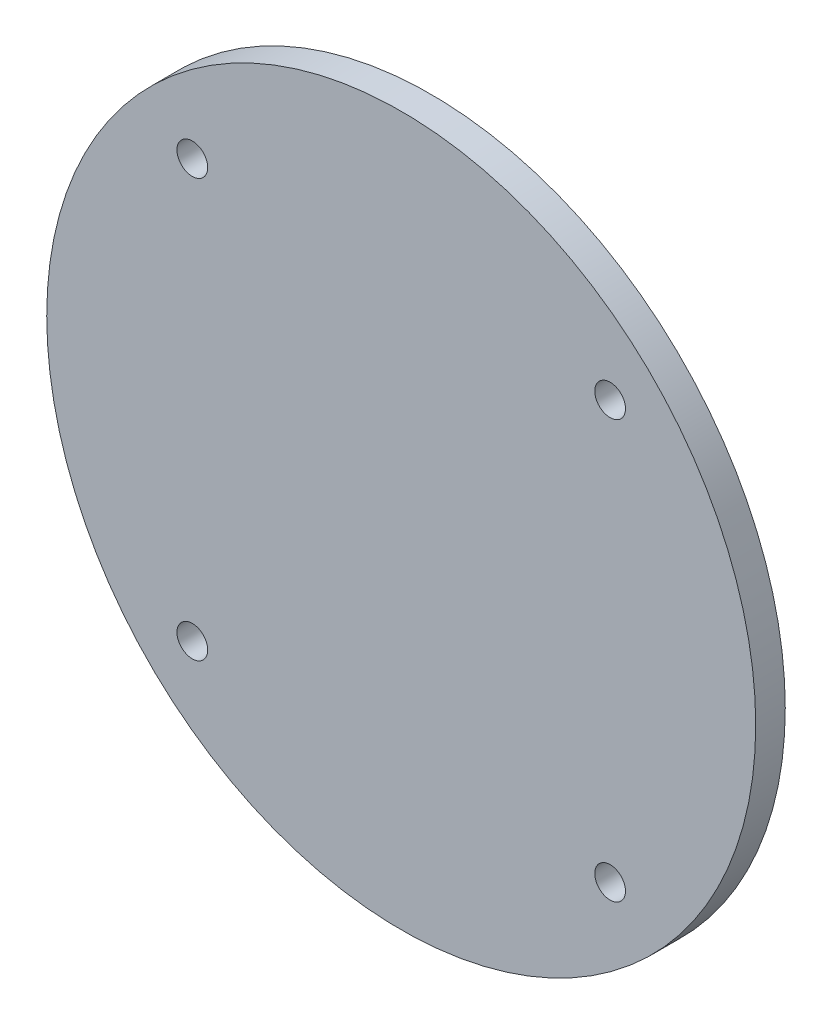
from build123d import *

# Parameters (mm, degrees)
SKETCH2_R      = 76.2
EXTRUDE1_DEPTH = 6.35
SKETCH3_R      = 3.302
EXTRUDE2_DEPTH = 6.35


with BuildPart() as part:
    # Sketch2 → Extrude1 (new body)
    with BuildSketch(Plane.XY):
        Circle(SKETCH2_R)
    extrude(amount=EXTRUDE1_DEPTH)

    # Sketch3 → Extrude2 (cut)
    with BuildSketch(Plane.XY.offset(6.35)):
        with Locations((-44.901280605, 44.901280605)):
            Circle(SKETCH3_R)
        with Locations((44.901280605, 44.901280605)):
            Circle(SKETCH3_R)
        with Locations((44.901280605, -44.901280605)):
            Circle(SKETCH3_R)
        with Locations((-44.901280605, -44.901280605)):
            Circle(SKETCH3_R)
    extrude(amount=-EXTRUDE2_DEPTH, mode=Mode.SUBTRACT)


solid = part.part
